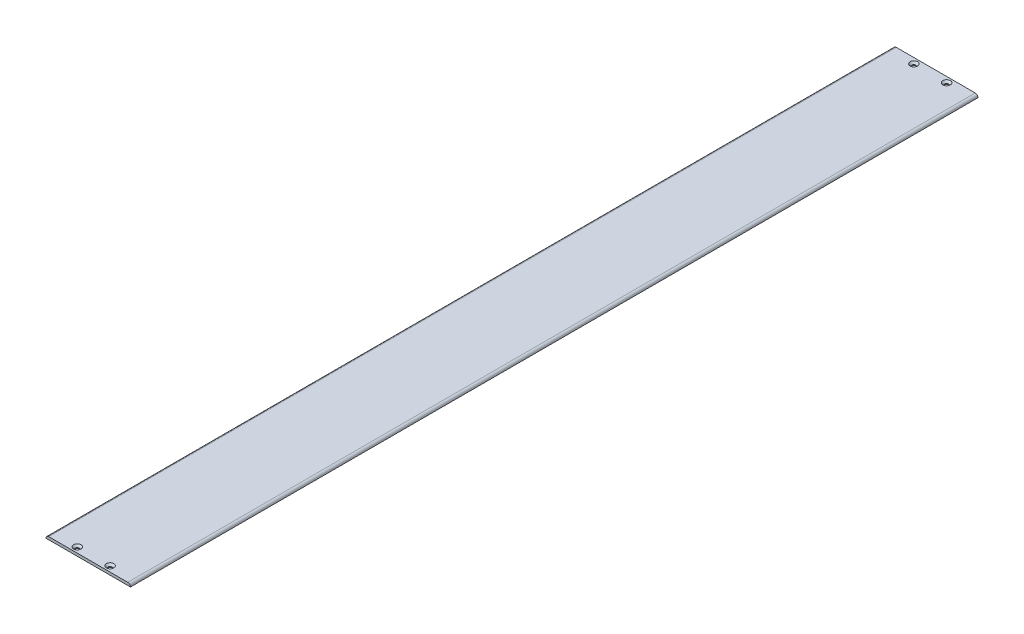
ISO-10303-21;
HEADER;
FILE_DESCRIPTION(('STEP AP214'),'2;1');
FILE_NAME('part.step','',(''),(''),'','','');
FILE_SCHEMA(('AUTOMOTIVE_DESIGN { 1 0 10303 214 1 1 1 1 }'));
ENDSEC;
DATA;
#1=APPLICATION_CONTEXT('core data for automotive mechanical design processes');
#2=APPLICATION_PROTOCOL_DEFINITION('international standard','automotive_design',2000,#1);
#3=PRODUCT_CONTEXT('',#1,'mechanical');
#4=PRODUCT('Part','Part','',(#3));
#5=PRODUCT_RELATED_PRODUCT_CATEGORY('part','',(#4));
#6=PRODUCT_DEFINITION_FORMATION('','',#4);
#7=PRODUCT_DEFINITION_CONTEXT('part definition',#1,'design');
#8=PRODUCT_DEFINITION('design','',#6,#7);
#9=PRODUCT_DEFINITION_SHAPE('','',#8);
#10=(LENGTH_UNIT() NAMED_UNIT(*) SI_UNIT(.MILLI.,.METRE.));
#11=(NAMED_UNIT(*) PLANE_ANGLE_UNIT() SI_UNIT($,.RADIAN.));
#12=(NAMED_UNIT(*) SI_UNIT($,.STERADIAN.) SOLID_ANGLE_UNIT());
#13=UNCERTAINTY_MEASURE_WITH_UNIT(LENGTH_MEASURE(1.E-05),#10,'distance_accuracy_value','');
#14=(GEOMETRIC_REPRESENTATION_CONTEXT(3) GLOBAL_UNCERTAINTY_ASSIGNED_CONTEXT((#13)) GLOBAL_UNIT_ASSIGNED_CONTEXT((#10,
#11,#12)) REPRESENTATION_CONTEXT('',''));
#15=CARTESIAN_POINT('',(0.,0.,0.));
#16=DIRECTION('',(0.,0.,1.));
#17=DIRECTION('',(1.,0.,0.));
#18=AXIS2_PLACEMENT_3D('',#15,#16,#17);
#19=CARTESIAN_POINT('',(-31.,0.,311.));
#20=DIRECTION('',(0.,1.,0.));
#21=DIRECTION('',(0.,0.,1.));
#22=AXIS2_PLACEMENT_3D('',#19,#20,#21);
#23=PLANE('',#22);
#24=CARTESIAN_POINT('',(-12.,0.,307.));
#25=DIRECTION('',(0.,1.,0.));
#26=DIRECTION('',(0.,0.,1.));
#27=AXIS2_PLACEMENT_3D('',#24,#25,#26);
#28=CIRCLE('',#27,1.35);
#29=CARTESIAN_POINT('',(-12.,0.,308.35));
#30=VERTEX_POINT('',#29);
#31=EDGE_CURVE('E139',#30,#30,#28,.T.);
#32=ORIENTED_EDGE('',*,*,#31,.T.);
#33=EDGE_LOOP('',(#32));
#34=FACE_BOUND('',#33,.T.);
#35=CARTESIAN_POINT('',(12.,0.,307.));
#36=DIRECTION('',(0.,1.,0.));
#37=DIRECTION('',(0.,0.,1.));
#38=AXIS2_PLACEMENT_3D('',#35,#36,#37);
#39=CIRCLE('',#38,1.35);
#40=CARTESIAN_POINT('',(12.,0.,308.35));
#41=VERTEX_POINT('',#40);
#42=EDGE_CURVE('E130',#41,#41,#39,.T.);
#43=ORIENTED_EDGE('',*,*,#42,.T.);
#44=EDGE_LOOP('',(#43));
#45=FACE_BOUND('',#44,.T.);
#46=CARTESIAN_POINT('',(12.,0.,-307.));
#47=DIRECTION('',(0.,1.,0.));
#48=DIRECTION('',(0.,0.,1.));
#49=AXIS2_PLACEMENT_3D('',#46,#47,#48);
#50=CIRCLE('',#49,1.35);
#51=CARTESIAN_POINT('',(12.,0.,-305.65));
#52=VERTEX_POINT('',#51);
#53=EDGE_CURVE('E121',#52,#52,#50,.T.);
#54=ORIENTED_EDGE('',*,*,#53,.T.);
#55=EDGE_LOOP('',(#54));
#56=FACE_BOUND('',#55,.T.);
#57=CARTESIAN_POINT('',(-12.,0.,-307.));
#58=DIRECTION('',(0.,1.,0.));
#59=DIRECTION('',(0.,0.,1.));
#60=AXIS2_PLACEMENT_3D('',#57,#58,#59);
#61=CIRCLE('',#60,1.35);
#62=CARTESIAN_POINT('',(-12.,0.,-305.65));
#63=VERTEX_POINT('',#62);
#64=EDGE_CURVE('E107',#63,#63,#61,.T.);
#65=ORIENTED_EDGE('',*,*,#64,.T.);
#66=EDGE_LOOP('',(#65));
#67=FACE_BOUND('',#66,.T.);
#68=DIRECTION('',(1.,0.,0.));
#69=VECTOR('',#68,1.);
#70=CARTESIAN_POINT('',(-31.,0.,-311.));
#71=LINE('',#70,#69);
#72=CARTESIAN_POINT('',(-31.,0.,-311.));
#73=VERTEX_POINT('',#72);
#74=CARTESIAN_POINT('',(31.,0.,-311.));
#75=VERTEX_POINT('',#74);
#76=EDGE_CURVE('E104',#73,#75,#71,.T.);
#77=ORIENTED_EDGE('',*,*,#76,.T.);
#78=DIRECTION('',(0.,0.,-1.));
#79=VECTOR('',#78,1.);
#80=CARTESIAN_POINT('',(31.,0.,311.));
#81=LINE('',#80,#79);
#82=CARTESIAN_POINT('',(31.,0.,311.));
#83=VERTEX_POINT('',#82);
#84=EDGE_CURVE('E87',#83,#75,#81,.T.);
#85=ORIENTED_EDGE('',*,*,#84,.F.);
#86=DIRECTION('',(1.,0.,0.));
#87=VECTOR('',#86,1.);
#88=CARTESIAN_POINT('',(-31.,0.,311.));
#89=LINE('',#88,#87);
#90=CARTESIAN_POINT('',(-31.,0.,311.));
#91=VERTEX_POINT('',#90);
#92=EDGE_CURVE('E76',#91,#83,#89,.T.);
#93=ORIENTED_EDGE('',*,*,#92,.F.);
#94=DIRECTION('',(0.,0.,-1.));
#95=VECTOR('',#94,1.);
#96=CARTESIAN_POINT('',(-31.,0.,311.));
#97=LINE('',#96,#95);
#98=EDGE_CURVE('E85',#91,#73,#97,.T.);
#99=ORIENTED_EDGE('',*,*,#98,.T.);
#100=EDGE_LOOP('',(#77,#85,#93,#99));
#101=FACE_BOUND('',#100,.T.);
#102=ADVANCED_FACE('F36',(#34,#45,#56,#67,#101),#23,.F.);
#103=CARTESIAN_POINT('',(-31.,2.,311.));
#104=DIRECTION('',(0.,-1.,0.));
#105=DIRECTION('',(0.,0.,-1.));
#106=AXIS2_PLACEMENT_3D('',#103,#104,#105);
#107=PLANE('',#106);
#108=CARTESIAN_POINT('',(-12.,2.,307.));
#109=DIRECTION('',(0.,1.,0.));
#110=DIRECTION('',(0.,0.,1.));
#111=AXIS2_PLACEMENT_3D('',#108,#109,#110);
#112=CIRCLE('',#111,2.75);
#113=CARTESIAN_POINT('',(-12.,2.,309.75));
#114=VERTEX_POINT('',#113);
#115=EDGE_CURVE('E145',#114,#114,#112,.T.);
#116=ORIENTED_EDGE('',*,*,#115,.F.);
#117=EDGE_LOOP('',(#116));
#118=FACE_BOUND('',#117,.T.);
#119=CARTESIAN_POINT('',(12.,2.,307.));
#120=DIRECTION('',(0.,1.,0.));
#121=DIRECTION('',(0.,0.,1.));
#122=AXIS2_PLACEMENT_3D('',#119,#120,#121);
#123=CIRCLE('',#122,2.75);
#124=CARTESIAN_POINT('',(12.,2.,309.75));
#125=VERTEX_POINT('',#124);
#126=EDGE_CURVE('E136',#125,#125,#123,.T.);
#127=ORIENTED_EDGE('',*,*,#126,.F.);
#128=EDGE_LOOP('',(#127));
#129=FACE_BOUND('',#128,.T.);
#130=CARTESIAN_POINT('',(12.,2.,-307.));
#131=DIRECTION('',(0.,1.,0.));
#132=DIRECTION('',(0.,0.,1.));
#133=AXIS2_PLACEMENT_3D('',#130,#131,#132);
#134=CIRCLE('',#133,2.75);
#135=CARTESIAN_POINT('',(12.,2.,-304.25));
#136=VERTEX_POINT('',#135);
#137=EDGE_CURVE('E127',#136,#136,#134,.T.);
#138=ORIENTED_EDGE('',*,*,#137,.F.);
#139=EDGE_LOOP('',(#138));
#140=FACE_BOUND('',#139,.T.);
#141=CARTESIAN_POINT('',(-12.,2.,-307.));
#142=DIRECTION('',(0.,1.,0.));
#143=DIRECTION('',(0.,0.,1.));
#144=AXIS2_PLACEMENT_3D('',#141,#142,#143);
#145=CIRCLE('',#144,2.75);
#146=CARTESIAN_POINT('',(-12.,2.,-304.25));
#147=VERTEX_POINT('',#146);
#148=EDGE_CURVE('E118',#147,#147,#145,.T.);
#149=ORIENTED_EDGE('',*,*,#148,.F.);
#150=EDGE_LOOP('',(#149));
#151=FACE_BOUND('',#150,.T.);
#152=DIRECTION('',(-1.,0.,0.));
#153=VECTOR('',#152,1.);
#154=CARTESIAN_POINT('',(-31.,2.,311.));
#155=LINE('',#154,#153);
#156=CARTESIAN_POINT('',(29.,2.,311.));
#157=VERTEX_POINT('',#156);
#158=CARTESIAN_POINT('',(-29.,2.,311.));
#159=VERTEX_POINT('',#158);
#160=EDGE_CURVE('E78',#157,#159,#155,.T.);
#161=ORIENTED_EDGE('',*,*,#160,.F.);
#162=DIRECTION('',(0.,0.,-1.));
#163=VECTOR('',#162,1.);
#164=CARTESIAN_POINT('',(29.,2.,311.));
#165=LINE('',#164,#163);
#166=CARTESIAN_POINT('',(29.,2.,-311.));
#167=VERTEX_POINT('',#166);
#168=EDGE_CURVE('E93',#157,#167,#165,.T.);
#169=ORIENTED_EDGE('',*,*,#168,.T.);
#170=DIRECTION('',(-1.,0.,0.));
#171=VECTOR('',#170,1.);
#172=CARTESIAN_POINT('',(-31.,2.,-311.));
#173=LINE('',#172,#171);
#174=CARTESIAN_POINT('',(-29.,2.,-311.));
#175=VERTEX_POINT('',#174);
#176=EDGE_CURVE('E88',#167,#175,#173,.T.);
#177=ORIENTED_EDGE('',*,*,#176,.T.);
#178=DIRECTION('',(0.,0.,-1.));
#179=VECTOR('',#178,1.);
#180=CARTESIAN_POINT('',(-29.,2.,311.));
#181=LINE('',#180,#179);
#182=EDGE_CURVE('E51',#175,#159,#181,.F.);
#183=ORIENTED_EDGE('',*,*,#182,.T.);
#184=EDGE_LOOP('',(#161,#169,#177,#183));
#185=FACE_BOUND('',#184,.T.);
#186=ADVANCED_FACE('F110',(#118,#129,#140,#151,#185),#107,.F.);
#187=CARTESIAN_POINT('',(-31.,0.,311.));
#188=DIRECTION('',(0.,0.,1.));
#189=DIRECTION('',(1.,0.,0.));
#190=AXIS2_PLACEMENT_3D('',#187,#188,#189);
#191=PLANE('',#190);
#192=ORIENTED_EDGE('',*,*,#92,.T.);
#193=CARTESIAN_POINT('',(29.,0.,311.));
#194=DIRECTION('',(0.,0.,1.));
#195=DIRECTION('',(1.,0.,0.));
#196=AXIS2_PLACEMENT_3D('',#193,#194,#195);
#197=CIRCLE('',#196,2.);
#198=EDGE_CURVE('E11',#83,#157,#197,.T.);
#199=ORIENTED_EDGE('',*,*,#198,.T.);
#200=ORIENTED_EDGE('',*,*,#160,.T.);
#201=CARTESIAN_POINT('',(-29.,0.,311.));
#202=DIRECTION('',(0.,0.,1.));
#203=DIRECTION('',(1.,0.,0.));
#204=AXIS2_PLACEMENT_3D('',#201,#202,#203);
#205=CIRCLE('',#204,2.);
#206=EDGE_CURVE('E44',#159,#91,#205,.T.);
#207=ORIENTED_EDGE('',*,*,#206,.T.);
#208=EDGE_LOOP('',(#192,#199,#200,#207));
#209=FACE_BOUND('',#208,.T.);
#210=ADVANCED_FACE('F75',(#209),#191,.T.);
#211=CARTESIAN_POINT('',(-31.,0.,-311.));
#212=DIRECTION('',(0.,0.,1.));
#213=DIRECTION('',(1.,0.,0.));
#214=AXIS2_PLACEMENT_3D('',#211,#212,#213);
#215=PLANE('',#214);
#216=ORIENTED_EDGE('',*,*,#176,.F.);
#217=CARTESIAN_POINT('',(29.,0.,-311.));
#218=DIRECTION('',(0.,0.,1.));
#219=DIRECTION('',(1.,0.,0.));
#220=AXIS2_PLACEMENT_3D('',#217,#218,#219);
#221=CIRCLE('',#220,2.);
#222=EDGE_CURVE('E81',#167,#75,#221,.F.);
#223=ORIENTED_EDGE('',*,*,#222,.T.);
#224=ORIENTED_EDGE('',*,*,#76,.F.);
#225=CARTESIAN_POINT('',(-29.,0.,-311.));
#226=DIRECTION('',(0.,0.,1.));
#227=DIRECTION('',(1.,0.,0.));
#228=AXIS2_PLACEMENT_3D('',#225,#226,#227);
#229=CIRCLE('',#228,2.);
#230=EDGE_CURVE('E90',#73,#175,#229,.F.);
#231=ORIENTED_EDGE('',*,*,#230,.T.);
#232=EDGE_LOOP('',(#216,#223,#224,#231));
#233=FACE_BOUND('',#232,.T.);
#234=ADVANCED_FACE('F103',(#233),#215,.F.);
#235=CARTESIAN_POINT('',(29.,0.,311.));
#236=DIRECTION('',(0.,0.,-1.));
#237=DIRECTION('',(-1.,0.,0.));
#238=AXIS2_PLACEMENT_3D('',#235,#236,#237);
#239=CYLINDRICAL_SURFACE('',#238,2.);
#240=ORIENTED_EDGE('',*,*,#198,.F.);
#241=ORIENTED_EDGE('',*,*,#84,.T.);
#242=ORIENTED_EDGE('',*,*,#222,.F.);
#243=ORIENTED_EDGE('',*,*,#168,.F.);
#244=EDGE_LOOP('',(#240,#241,#242,#243));
#245=FACE_BOUND('',#244,.T.);
#246=ADVANCED_FACE('F109',(#245),#239,.T.);
#247=CARTESIAN_POINT('',(-29.,0.,311.));
#248=DIRECTION('',(0.,0.,-1.));
#249=DIRECTION('',(-1.,0.,0.));
#250=AXIS2_PLACEMENT_3D('',#247,#248,#249);
#251=CYLINDRICAL_SURFACE('',#250,2.);
#252=ORIENTED_EDGE('',*,*,#206,.F.);
#253=ORIENTED_EDGE('',*,*,#182,.F.);
#254=ORIENTED_EDGE('',*,*,#230,.F.);
#255=ORIENTED_EDGE('',*,*,#98,.F.);
#256=EDGE_LOOP('',(#252,#253,#254,#255));
#257=FACE_BOUND('',#256,.T.);
#258=ADVANCED_FACE('F38',(#257),#251,.T.);
#259=CARTESIAN_POINT('',(-12.,2.,-307.));
#260=DIRECTION('',(0.,1.,0.));
#261=DIRECTION('',(0.,0.,1.));
#262=AXIS2_PLACEMENT_3D('',#259,#260,#261);
#263=CYLINDRICAL_SURFACE('',#262,1.34999999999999);
#264=ORIENTED_EDGE('',*,*,#64,.F.);
#265=EDGE_LOOP('',(#264));
#266=FACE_BOUND('',#265,.T.);
#267=CARTESIAN_POINT('',(-12.,0.599999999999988,-307.));
#268=DIRECTION('',(0.,1.,0.));
#269=DIRECTION('',(0.,0.,1.));
#270=AXIS2_PLACEMENT_3D('',#267,#268,#269);
#271=CIRCLE('',#270,1.34999999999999);
#272=CARTESIAN_POINT('',(-12.,0.599999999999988,-305.65));
#273=VERTEX_POINT('',#272);
#274=EDGE_CURVE('E115',#273,#273,#271,.T.);
#275=ORIENTED_EDGE('',*,*,#274,.T.);
#276=EDGE_LOOP('',(#275));
#277=FACE_BOUND('',#276,.T.);
#278=ADVANCED_FACE('F163',(#266,#277),#263,.F.);
#279=CARTESIAN_POINT('',(-12.,2.,-307.));
#280=DIRECTION('',(0.,1.,0.));
#281=DIRECTION('',(0.,0.,1.));
#282=AXIS2_PLACEMENT_3D('',#279,#280,#281);
#283=CONICAL_SURFACE('',#282,2.75,0.785398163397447);
#284=ORIENTED_EDGE('',*,*,#274,.F.);
#285=EDGE_LOOP('',(#284));
#286=FACE_BOUND('',#285,.T.);
#287=ORIENTED_EDGE('',*,*,#148,.T.);
#288=EDGE_LOOP('',(#287));
#289=FACE_BOUND('',#288,.T.);
#290=ADVANCED_FACE('F160',(#286,#289),#283,.F.);
#291=CARTESIAN_POINT('',(12.,2.,-307.));
#292=DIRECTION('',(0.,1.,0.));
#293=DIRECTION('',(0.,0.,1.));
#294=AXIS2_PLACEMENT_3D('',#291,#292,#293);
#295=CYLINDRICAL_SURFACE('',#294,1.34999999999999);
#296=ORIENTED_EDGE('',*,*,#53,.F.);
#297=EDGE_LOOP('',(#296));
#298=FACE_BOUND('',#297,.T.);
#299=CARTESIAN_POINT('',(12.,0.599999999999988,-307.));
#300=DIRECTION('',(0.,1.,0.));
#301=DIRECTION('',(0.,0.,1.));
#302=AXIS2_PLACEMENT_3D('',#299,#300,#301);
#303=CIRCLE('',#302,1.34999999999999);
#304=CARTESIAN_POINT('',(12.,0.599999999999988,-305.65));
#305=VERTEX_POINT('',#304);
#306=EDGE_CURVE('E124',#305,#305,#303,.T.);
#307=ORIENTED_EDGE('',*,*,#306,.T.);
#308=EDGE_LOOP('',(#307));
#309=FACE_BOUND('',#308,.T.);
#310=ADVANCED_FACE('F162',(#298,#309),#295,.F.);
#311=CARTESIAN_POINT('',(12.,2.,-307.));
#312=DIRECTION('',(0.,1.,0.));
#313=DIRECTION('',(0.,0.,1.));
#314=AXIS2_PLACEMENT_3D('',#311,#312,#313);
#315=CONICAL_SURFACE('',#314,2.75,0.785398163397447);
#316=ORIENTED_EDGE('',*,*,#306,.F.);
#317=EDGE_LOOP('',(#316));
#318=FACE_BOUND('',#317,.T.);
#319=ORIENTED_EDGE('',*,*,#137,.T.);
#320=EDGE_LOOP('',(#319));
#321=FACE_BOUND('',#320,.T.);
#322=ADVANCED_FACE('F170',(#318,#321),#315,.F.);
#323=CARTESIAN_POINT('',(12.,2.,307.));
#324=DIRECTION('',(0.,1.,0.));
#325=DIRECTION('',(0.,0.,1.));
#326=AXIS2_PLACEMENT_3D('',#323,#324,#325);
#327=CYLINDRICAL_SURFACE('',#326,1.34999999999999);
#328=ORIENTED_EDGE('',*,*,#42,.F.);
#329=EDGE_LOOP('',(#328));
#330=FACE_BOUND('',#329,.T.);
#331=CARTESIAN_POINT('',(12.,0.599999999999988,307.));
#332=DIRECTION('',(0.,1.,0.));
#333=DIRECTION('',(0.,0.,1.));
#334=AXIS2_PLACEMENT_3D('',#331,#332,#333);
#335=CIRCLE('',#334,1.34999999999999);
#336=CARTESIAN_POINT('',(12.,0.599999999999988,308.35));
#337=VERTEX_POINT('',#336);
#338=EDGE_CURVE('E133',#337,#337,#335,.T.);
#339=ORIENTED_EDGE('',*,*,#338,.T.);
#340=EDGE_LOOP('',(#339));
#341=FACE_BOUND('',#340,.T.);
#342=ADVANCED_FACE('F227',(#330,#341),#327,.F.);
#343=CARTESIAN_POINT('',(12.,2.,307.));
#344=DIRECTION('',(0.,1.,0.));
#345=DIRECTION('',(0.,0.,1.));
#346=AXIS2_PLACEMENT_3D('',#343,#344,#345);
#347=CONICAL_SURFACE('',#346,2.75,0.785398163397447);
#348=ORIENTED_EDGE('',*,*,#338,.F.);
#349=EDGE_LOOP('',(#348));
#350=FACE_BOUND('',#349,.T.);
#351=ORIENTED_EDGE('',*,*,#126,.T.);
#352=EDGE_LOOP('',(#351));
#353=FACE_BOUND('',#352,.T.);
#354=ADVANCED_FACE('F237',(#350,#353),#347,.F.);
#355=CARTESIAN_POINT('',(-12.,2.,307.));
#356=DIRECTION('',(0.,1.,0.));
#357=DIRECTION('',(0.,0.,1.));
#358=AXIS2_PLACEMENT_3D('',#355,#356,#357);
#359=CYLINDRICAL_SURFACE('',#358,1.34999999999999);
#360=ORIENTED_EDGE('',*,*,#31,.F.);
#361=EDGE_LOOP('',(#360));
#362=FACE_BOUND('',#361,.T.);
#363=CARTESIAN_POINT('',(-12.,0.599999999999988,307.));
#364=DIRECTION('',(0.,1.,0.));
#365=DIRECTION('',(0.,0.,1.));
#366=AXIS2_PLACEMENT_3D('',#363,#364,#365);
#367=CIRCLE('',#366,1.34999999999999);
#368=CARTESIAN_POINT('',(-12.,0.599999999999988,308.35));
#369=VERTEX_POINT('',#368);
#370=EDGE_CURVE('E142',#369,#369,#367,.T.);
#371=ORIENTED_EDGE('',*,*,#370,.T.);
#372=EDGE_LOOP('',(#371));
#373=FACE_BOUND('',#372,.T.);
#374=ADVANCED_FACE('F247',(#362,#373),#359,.F.);
#375=CARTESIAN_POINT('',(-12.,2.,307.));
#376=DIRECTION('',(0.,1.,0.));
#377=DIRECTION('',(0.,0.,1.));
#378=AXIS2_PLACEMENT_3D('',#375,#376,#377);
#379=CONICAL_SURFACE('',#378,2.75,0.785398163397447);
#380=ORIENTED_EDGE('',*,*,#370,.F.);
#381=EDGE_LOOP('',(#380));
#382=FACE_BOUND('',#381,.T.);
#383=ORIENTED_EDGE('',*,*,#115,.T.);
#384=EDGE_LOOP('',(#383));
#385=FACE_BOUND('',#384,.T.);
#386=ADVANCED_FACE('F149',(#382,#385),#379,.F.);
#387=CLOSED_SHELL('',(#102,#186,#210,#234,#246,#258,#278,#290,#310,#322,#342,#354,#374,#386));
#388=MANIFOLD_SOLID_BREP('B2',#387);
#389=ADVANCED_BREP_SHAPE_REPRESENTATION('',(#18,#388),#14);
#390=SHAPE_DEFINITION_REPRESENTATION(#9,#389);
ENDSEC;
END-ISO-10303-21;
